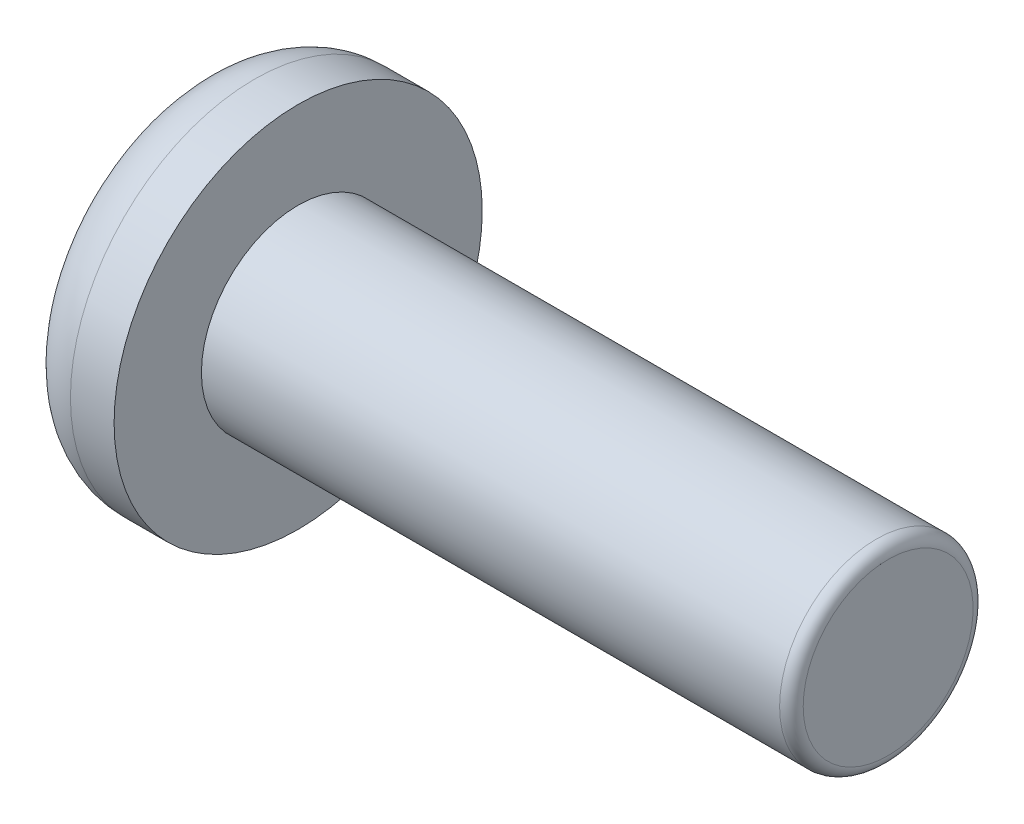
from build123d import *

# Parameters (mm, degrees)
CUT_EXTRUDE1_DEPTH = 2.54
FILLET1_R          = 0.254


with BuildPart() as part:
    # Sketch1 → Base-Revolve (revolve)
    with BuildSketch(Plane.XY, mode=Mode.PRIVATE) as base_revolve_sk:
        with BuildLine():
            Line((0, 0), (0, 2.6924))
            ThreePointArc((0, 2.6924), (0.371974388, 3.590425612), (1.27, 3.9624))
            Line((1.27, 3.9624), (2.2098, 3.9624))
            Line((2.2098, 3.9624), (2.2098, 2.0828))
            Line((2.2098, 2.0828), (14.9098, 2.0828))
            Line((14.9098, 2.0828), (14.9098, 0))
            Line((14.9098, 0), (0, 0))
        make_face()
    revolve(base_revolve_sk.sketch.rotate(Axis((0, 0, 0), (1, 0, 0)), 90), axis=Axis((0, 0, 0), (1, 0, 0)))

    # Hexagon - circumscribed1 → Cut-Extrude1 (cut)
    with BuildSketch(Plane(origin=(0, 0.012462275, -0.031513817), x_dir=(0, 0, 1), z_dir=(-1, 0, 0))):
        Polygon((-0.655893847, 1.178162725), (0.718921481, 1.178162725), (1.406329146, -0.012462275), (0.718921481, -1.203087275), (-0.655893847, -1.203087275), (-1.343301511, -0.012462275), align=None)
    extrude(amount=-CUT_EXTRUDE1_DEPTH, mode=Mode.SUBTRACT)

    # Fillet1
    fillet1_edges = [part.edges().sort_by_distance(p)[0] for p in [
        (14.9098, 0, -2.0828),
    ]]
    fillet(fillet1_edges, radius=FILLET1_R)


solid = part.part
